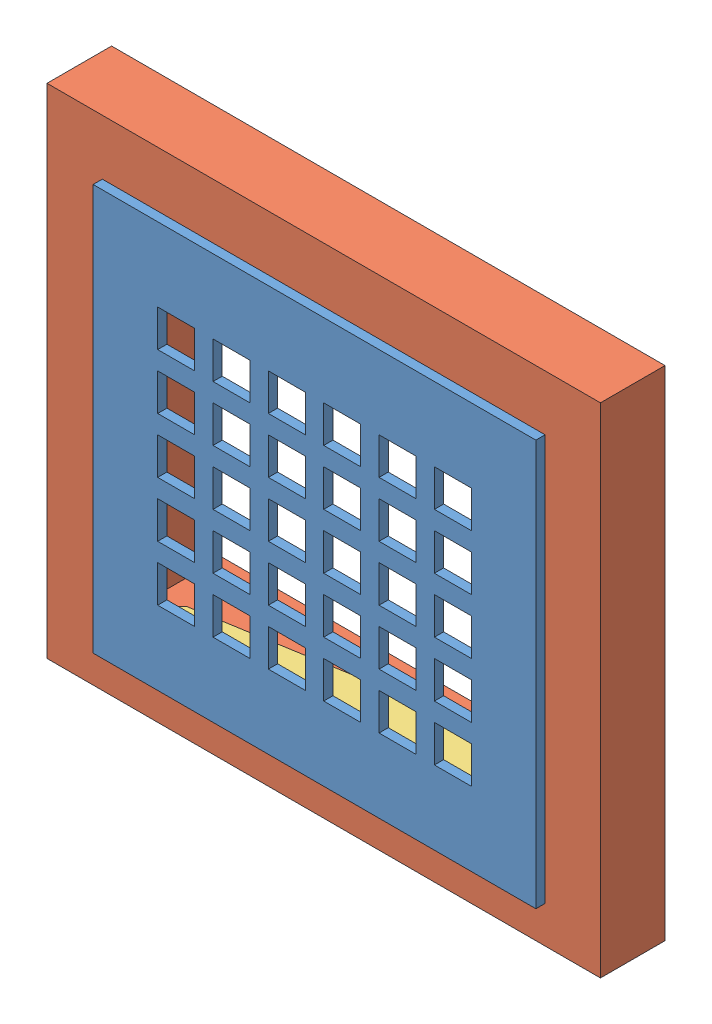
SolidWorks assembly 607 - 1.SLDASM, configuration Default (file format 11000). Lengths in mm.
Overall size (152.4 139.7 22.23).
4 component instances, 3 part files, 6 mates.
Components (placement in the parent):
- 208 Lattice Perforated Grille(3_8 HS)-1: 208 Lattice Perforated Grille(3_8 HS).SLDPRT [Default] at origin size (152.4 139.7 3.17)
- Opening (Wall_Floor_Ceiling)-1: Opening (Wall_Floor_Ceiling).SLDPRT [Default] at (0 3.175 -22.225) size (190.5 171.45 22.23) (hidden)
- Stiffener Bar (Provided)-1: Stiffener Bar (Provided).SLDPRT [Default] at (0 -47.625 0) x (0 1 0) z (1 0 0) size (3.17 19.05 114.3)
- Stiffener Bar (Provided)-2: Stiffener Bar (Provided).SLDPRT [Default] at (0 47.625 0) x (0 -1 0) z (-1 0 0) size (3.17 19.05 114.3)
Mates (geometry in assembly coordinates):
- Coincident1: coincident: plane of 208 Lattice Perforated Grille(3_8 HS)-1 through (0 0 0) normal (0 0 -1); plane of Opening (Wall_Floor_Ceiling)-1 through (0 3.175 0) normal (0 0 1)
- Distance1: distance = 19.05 mm: plane of 208 Lattice Perforated Grille(3_8 HS)-1 through (-76.2 69.85 3.175) normal (0 1 0); plane of Opening (Wall_Floor_Ceiling)-1 through (-57.15 50.8 0) normal (0 -1 0)
- Distance2: distance = 19.05 mm: plane of 208 Lattice Perforated Grille(3_8 HS)-1 through (76.2 69.85 3.175) normal (1 0 0); plane of Opening (Wall_Floor_Ceiling)-1 through (57.15 50.8 0) normal (-1 0 0)
- Coincident5: coincident: plane of 208 Lattice Perforated Grille(3_8 HS)-1 through (0 0 0) normal (0 0 -1); plane of Stiffener Bar (Provided)-1 through (57.15 -44.45 0) normal (0 0 1)
- Coincident7: coincident: plane of Opening (Wall_Floor_Ceiling)-1 through (57.15 50.8 0) normal (-1 0 0); plane of Stiffener Bar (Provided)-1 through (57.15 -44.45 0) normal (1 0 0)
- Coincident8: coincident: plane of assembly; plane of assembly; plane of 208 Lattice Perforated Grille(3_8 HS)-1 through (41.275 -44.45 0) normal (0 1 0); plane of Stiffener Bar (Provided)-1 through (57.15 -44.45 0) normal (0 1 0)
